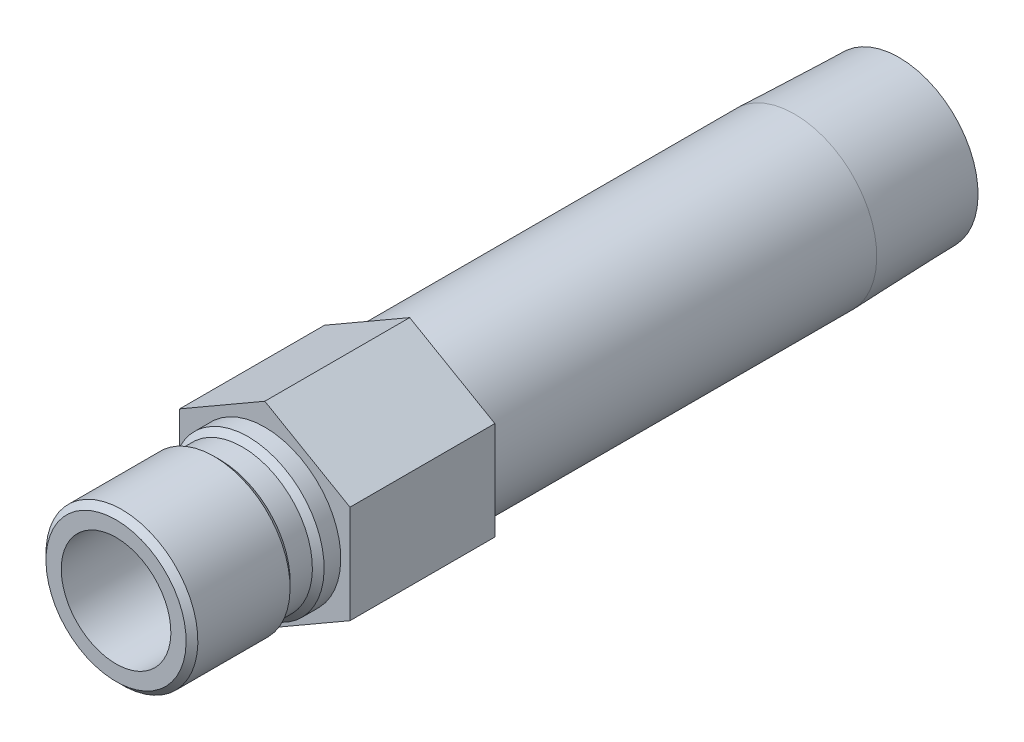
from build123d import *

# Parameters (mm, degrees)
SKETCH2_R           = 7.112
BOSS_EXTRUDE1_DEPTH = 18.796


with BuildPart() as part:
    # Sketch1 → Revolve1 (revolve)
    with BuildSketch(Plane(origin=(0, 0, 0), x_dir=(0, 0, -1), z_dir=(1, 0, 0))):
        Polygon((-19.304, 7.112), (-19.304, 9.0932), (-18.542, 9.8552), (-6.5786, 9.8552), (-5.8166, 9.0932), (-2.921, 9.0932), (-2.159, 9.8552), (0, 9.8552), (0, 10.668), (68.7324, 10.668), (82.296, 10.244140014), (82.296, 7.8994), (-1.105331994, 7.8994), (-1.524, 7.112), align=None)
    revolve(axis=Axis((0, 0, 0), (0, 0, 1)))

    # Sketch2 → Boss-Extrude1 (add)
    with BuildSketch(Plane.XY):
        Polygon((-11.049, 6.379143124), (-11.049, -6.379143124), (0, -12.758286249), (11.049, -6.379143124), (11.049, 6.379143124), (0, 12.758286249), align=None)
        with Locations(Location((0, 0, 0), (0, 0, 90))):
            Circle(SKETCH2_R, mode=Mode.SUBTRACT)
    extrude(amount=-BOSS_EXTRUDE1_DEPTH)


solid = part.part
